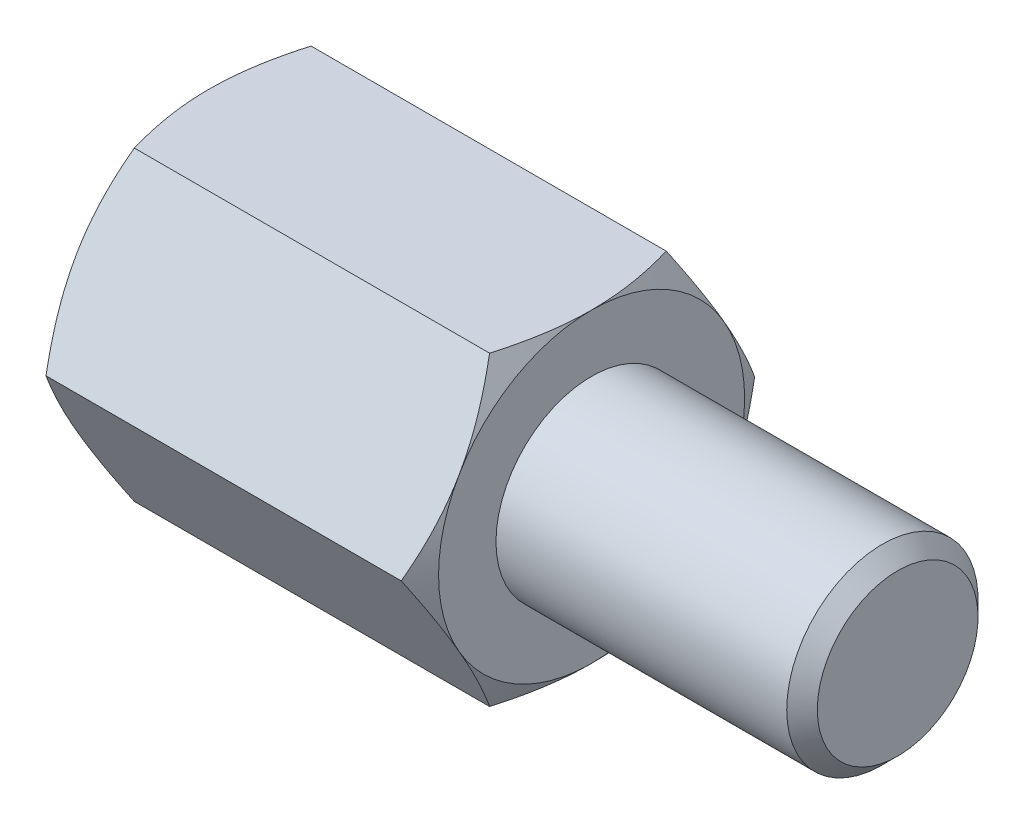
ISO-10303-21;
HEADER;
FILE_DESCRIPTION(('STEP AP214'),'2;1');
FILE_NAME('part.step','',(''),(''),'','','');
FILE_SCHEMA(('AUTOMOTIVE_DESIGN { 1 0 10303 214 1 1 1 1 }'));
ENDSEC;
DATA;
#1=APPLICATION_CONTEXT('core data for automotive mechanical design processes');
#2=APPLICATION_PROTOCOL_DEFINITION('international standard','automotive_design',2000,#1);
#3=PRODUCT_CONTEXT('',#1,'mechanical');
#4=PRODUCT('Part','Part','',(#3));
#5=PRODUCT_RELATED_PRODUCT_CATEGORY('part','',(#4));
#6=PRODUCT_DEFINITION_FORMATION('','',#4);
#7=PRODUCT_DEFINITION_CONTEXT('part definition',#1,'design');
#8=PRODUCT_DEFINITION('design','',#6,#7);
#9=PRODUCT_DEFINITION_SHAPE('','',#8);
#10=(LENGTH_UNIT() NAMED_UNIT(*) SI_UNIT(.MILLI.,.METRE.));
#11=(NAMED_UNIT(*) PLANE_ANGLE_UNIT() SI_UNIT($,.RADIAN.));
#12=(NAMED_UNIT(*) SI_UNIT($,.STERADIAN.) SOLID_ANGLE_UNIT());
#13=UNCERTAINTY_MEASURE_WITH_UNIT(LENGTH_MEASURE(1.E-05),#10,'distance_accuracy_value','');
#14=(GEOMETRIC_REPRESENTATION_CONTEXT(3) GLOBAL_UNCERTAINTY_ASSIGNED_CONTEXT((#13)) GLOBAL_UNIT_ASSIGNED_CONTEXT((#10,
#11,#12)) REPRESENTATION_CONTEXT('',''));
#15=CARTESIAN_POINT('',(0.,0.,0.));
#16=DIRECTION('',(0.,0.,1.));
#17=DIRECTION('',(1.,0.,0.));
#18=AXIS2_PLACEMENT_3D('',#15,#16,#17);
#19=CARTESIAN_POINT('',(5.,4.,-2.3094010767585));
#20=DIRECTION('',(1.,0.,0.));
#21=DIRECTION('',(0.,0.,-1.));
#22=AXIS2_PLACEMENT_3D('',#19,#20,#21);
#23=PLANE('',#22);
#24=CARTESIAN_POINT('',(5.,0.,0.));
#25=DIRECTION('',(1.,0.,0.));
#26=DIRECTION('',(0.,0.,-1.));
#27=AXIS2_PLACEMENT_3D('',#24,#25,#26);
#28=CIRCLE('',#27,4.);
#29=CARTESIAN_POINT('',(5.,-2.,-3.46410161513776));
#30=VERTEX_POINT('',#29);
#31=CARTESIAN_POINT('',(5.,2.,-3.46410161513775));
#32=VERTEX_POINT('',#31);
#33=EDGE_CURVE('E288',#30,#32,#28,.T.);
#34=ORIENTED_EDGE('',*,*,#33,.T.);
#35=CARTESIAN_POINT('',(5.,4.,0.));
#36=VERTEX_POINT('',#35);
#37=EDGE_CURVE('E53',#32,#36,#28,.T.);
#38=ORIENTED_EDGE('',*,*,#37,.T.);
#39=CARTESIAN_POINT('',(5.,2.,3.46410161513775));
#40=VERTEX_POINT('',#39);
#41=EDGE_CURVE('E297',#36,#40,#28,.T.);
#42=ORIENTED_EDGE('',*,*,#41,.T.);
#43=CARTESIAN_POINT('',(5.,-2.,3.46410161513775));
#44=VERTEX_POINT('',#43);
#45=EDGE_CURVE('E301',#40,#44,#28,.T.);
#46=ORIENTED_EDGE('',*,*,#45,.T.);
#47=CARTESIAN_POINT('',(5.,0.,0.));
#48=DIRECTION('',(-1.,0.,0.));
#49=DIRECTION('',(0.,-1.,0.));
#50=AXIS2_PLACEMENT_3D('',#47,#48,#49);
#51=CIRCLE('',#50,4.);
#52=CARTESIAN_POINT('',(5.,-4.,0.));
#53=VERTEX_POINT('',#52);
#54=EDGE_CURVE('E193',#53,#44,#51,.T.);
#55=ORIENTED_EDGE('',*,*,#54,.F.);
#56=EDGE_CURVE('E61',#53,#30,#28,.T.);
#57=ORIENTED_EDGE('',*,*,#56,.T.);
#58=EDGE_LOOP('',(#34,#38,#42,#46,#55,#57));
#59=FACE_BOUND('',#58,.T.);
#60=CARTESIAN_POINT('',(5.,0.,0.));
#61=DIRECTION('',(1.,0.,0.));
#62=DIRECTION('',(0.,0.,-1.));
#63=AXIS2_PLACEMENT_3D('',#60,#61,#62);
#64=CIRCLE('',#63,2.5);
#65=CARTESIAN_POINT('',(5.,0.,-2.5));
#66=VERTEX_POINT('',#65);
#67=EDGE_CURVE('E311',#66,#66,#64,.T.);
#68=ORIENTED_EDGE('',*,*,#67,.F.);
#69=EDGE_LOOP('',(#68));
#70=FACE_BOUND('',#69,.T.);
#71=ADVANCED_FACE('F37',(#59,#70),#23,.T.);
#72=CARTESIAN_POINT('',(5.,0.,-4.61880215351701));
#73=DIRECTION('',(0.,-0.5,0.866025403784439));
#74=DIRECTION('',(0.,-0.866025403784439,-0.5));
#75=AXIS2_PLACEMENT_3D('',#72,#73,#74);
#76=PLANE('',#75);
#77=CARTESIAN_POINT('',(4.64266774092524,-0.000200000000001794,-4.61891762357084));
#78=CARTESIAN_POINT('',(4.70128212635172,0.175579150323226,-4.5174314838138));
#79=CARTESIAN_POINT('',(4.75458967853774,0.352875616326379,-4.41506932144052));
#80=CARTESIAN_POINT('',(4.8476383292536,0.710538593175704,-4.2085725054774));
#81=CARTESIAN_POINT('',(4.8873465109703,0.890911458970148,-4.10443418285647));
#82=CARTESIAN_POINT('',(4.94915778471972,1.24942181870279,-3.89744813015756));
#83=CARTESIAN_POINT('',(4.97167226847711,1.42750415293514,-3.79463224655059));
#84=CARTESIAN_POINT('',(4.99854937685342,1.78450671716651,-3.58851671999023));
#85=CARTESIAN_POINT('',(5.00293425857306,1.9634256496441,-3.48521782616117));
#86=CARTESIAN_POINT('',(4.99380992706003,2.29774284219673,-3.29219970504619));
#87=CARTESIAN_POINT('',(4.98254104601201,2.45319115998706,-3.20245157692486));
#88=CARTESIAN_POINT('',(4.94682600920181,2.76307505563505,-3.02354002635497));
#89=CARTESIAN_POINT('',(4.92236765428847,2.91750956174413,-2.93437722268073));
#90=CARTESIAN_POINT('',(4.86122393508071,3.22803232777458,-2.75509682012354));
#91=CARTESIAN_POINT('',(4.82427939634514,3.3840812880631,-2.6650019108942));
#92=CARTESIAN_POINT('',(4.74042992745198,3.69385183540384,-2.486155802));
#93=CARTESIAN_POINT('',(4.69354469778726,3.84757739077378,-2.39740231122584));
#94=CARTESIAN_POINT('',(4.64266774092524,4.0002,-2.30928560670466));
#95=B_SPLINE_CURVE_WITH_KNOTS('',3,(#77,#78,#79,#80,#81,#82,#83,#84,#85,#86,#87,#88,#89,#90,#91,
#92,#93,#94),.UNSPECIFIED.,.F.,.F.,(4,2,2,2,2,2,2,2,4),(0.,0.634047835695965,1.26961969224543,
1.88946157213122,2.50854226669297,3.04757825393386,3.58711366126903,4.13861653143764,
4.68903648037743),.UNSPECIFIED.);
#96=CARTESIAN_POINT('',(4.64273441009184,0.,-4.61880215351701));
#97=VERTEX_POINT('',#96);
#98=EDGE_CURVE('E343',#97,#32,#95,.T.);
#99=ORIENTED_EDGE('',*,*,#98,.F.);
#100=DIRECTION('',(-1.,0.,0.));
#101=VECTOR('',#100,1.);
#102=CARTESIAN_POINT('',(5.,0.,-4.61880215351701));
#103=LINE('',#102,#101);
#104=CARTESIAN_POINT('',(-4.64273441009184,0.,-4.61880215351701));
#105=VERTEX_POINT('',#104);
#106=EDGE_CURVE('E264',#97,#105,#103,.T.);
#107=ORIENTED_EDGE('',*,*,#106,.T.);
#108=CARTESIAN_POINT('',(-4.64266774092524,4.0002,-2.30928560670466));
#109=CARTESIAN_POINT('',(-4.70128212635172,3.82442084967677,-2.4107717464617));
#110=CARTESIAN_POINT('',(-4.75458967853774,3.64712438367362,-2.51313390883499));
#111=CARTESIAN_POINT('',(-4.8476383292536,3.28946140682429,-2.71963072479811));
#112=CARTESIAN_POINT('',(-4.8873465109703,3.10908854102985,-2.82376904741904));
#113=CARTESIAN_POINT('',(-4.94915778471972,2.75057818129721,-3.03075510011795));
#114=CARTESIAN_POINT('',(-4.97167226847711,2.57249584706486,-3.13357098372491));
#115=CARTESIAN_POINT('',(-4.99854937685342,2.21549328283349,-3.33968651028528));
#116=CARTESIAN_POINT('',(-5.00293425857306,2.0365743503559,-3.44298540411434));
#117=CARTESIAN_POINT('',(-4.99380992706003,1.70225715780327,-3.63600352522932));
#118=CARTESIAN_POINT('',(-4.98254104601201,1.54680884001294,-3.72575165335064));
#119=CARTESIAN_POINT('',(-4.94682600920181,1.23692494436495,-3.90466320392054));
#120=CARTESIAN_POINT('',(-4.92236765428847,1.08249043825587,-3.99382600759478));
#121=CARTESIAN_POINT('',(-4.86122393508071,0.771967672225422,-4.17310641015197));
#122=CARTESIAN_POINT('',(-4.82427939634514,0.615918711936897,-4.26320131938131));
#123=CARTESIAN_POINT('',(-4.74042992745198,0.30614816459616,-4.4420474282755));
#124=CARTESIAN_POINT('',(-4.69354469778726,0.152422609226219,-4.53080091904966));
#125=CARTESIAN_POINT('',(-4.64266774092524,-0.000200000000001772,-4.61891762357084));
#126=B_SPLINE_CURVE_WITH_KNOTS('',3,(#108,#109,#110,#111,#112,#113,#114,#115,#116,#117,#118,
#119,#120,#121,#122,#123,#124,#125),.UNSPECIFIED.,.F.,.F.,(4,2,2,2,2,2,2,2,4),(0.,
0.634047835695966,1.26961969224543,1.88946157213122,2.50854226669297,3.04757825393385,
3.58711366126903,4.13861653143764,4.68903648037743),.UNSPECIFIED.);
#127=CARTESIAN_POINT('',(-5.,2.,-3.46410161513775));
#128=VERTEX_POINT('',#127);
#129=EDGE_CURVE('E361',#128,#105,#126,.T.);
#130=ORIENTED_EDGE('',*,*,#129,.F.);
#131=CARTESIAN_POINT('',(-4.64273441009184,4.,-2.3094010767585));
#132=VERTEX_POINT('',#131);
#133=EDGE_CURVE('E365',#132,#128,#126,.T.);
#134=ORIENTED_EDGE('',*,*,#133,.F.);
#135=DIRECTION('',(-1.,0.,0.));
#136=VECTOR('',#135,1.);
#137=CARTESIAN_POINT('',(5.,4.,-2.3094010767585));
#138=LINE('',#137,#136);
#139=CARTESIAN_POINT('',(4.64273441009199,4.,-2.30940107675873));
#140=VERTEX_POINT('',#139);
#141=EDGE_CURVE('E279',#140,#132,#138,.T.);
#142=ORIENTED_EDGE('',*,*,#141,.F.);
#143=EDGE_CURVE('E229',#32,#140,#95,.T.);
#144=ORIENTED_EDGE('',*,*,#143,.F.);
#145=EDGE_LOOP('',(#99,#107,#130,#134,#142,#144));
#146=FACE_BOUND('',#145,.T.);
#147=ADVANCED_FACE('F148',(#146),#76,.F.);
#148=CARTESIAN_POINT('',(5.,4.,-2.3094010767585));
#149=DIRECTION('',(0.,-1.,0.));
#150=DIRECTION('',(0.,0.,-1.));
#151=AXIS2_PLACEMENT_3D('',#148,#149,#150);
#152=PLANE('',#151);
#153=CARTESIAN_POINT('',(3.00829070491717,4.,-6.28479524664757));
#154=CARTESIAN_POINT('',(3.09370060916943,4.,-6.10939349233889));
#155=CARTESIAN_POINT('',(3.17831482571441,4.,-5.93359774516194));
#156=CARTESIAN_POINT('',(3.34550596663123,4.,-5.58100905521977));
#157=CARTESIAN_POINT('',(3.42808258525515,4.,-5.40421596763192));
#158=CARTESIAN_POINT('',(3.59115082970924,4.,-5.04855089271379));
#159=CARTESIAN_POINT('',(3.67162934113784,4.,-4.86967287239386));
#160=CARTESIAN_POINT('',(3.82940015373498,4.,-4.51052237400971));
#161=CARTESIAN_POINT('',(3.90669260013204,4.,-4.33024995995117));
#162=CARTESIAN_POINT('',(4.05980205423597,4.,-3.96189114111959));
#163=CARTESIAN_POINT('',(4.135480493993,4.,-3.77374683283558));
#164=CARTESIAN_POINT('',(4.28130452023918,4.,-3.39528725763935));
#165=CARTESIAN_POINT('',(4.35144949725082,4.,-3.2049717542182));
#166=CARTESIAN_POINT('',(4.4844245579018,4.,-2.82219775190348));
#167=CARTESIAN_POINT('',(4.5472687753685,4.,-2.62974421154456));
#168=CARTESIAN_POINT('',(4.66367969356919,4.,-2.24207725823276));
#169=CARTESIAN_POINT('',(4.71724923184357,4.,-2.04686470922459));
#170=CARTESIAN_POINT('',(4.81230316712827,4.,-1.65467425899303));
#171=CARTESIAN_POINT('',(4.85385633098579,4.,-1.45771333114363));
#172=CARTESIAN_POINT('',(4.92259036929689,4.,-1.06125849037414));
#173=CARTESIAN_POINT('',(4.94977273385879,4.,-0.861764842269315));
#174=CARTESIAN_POINT('',(4.98724473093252,4.,-0.463879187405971));
#175=CARTESIAN_POINT('',(4.99775780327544,4.,-0.265508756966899));
#176=CARTESIAN_POINT('',(5.00159342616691,4.,0.131417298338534));
#177=CARTESIAN_POINT('',(4.99491584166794,4.,0.329972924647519));
#178=CARTESIAN_POINT('',(4.96964892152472,4.,0.664692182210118));
#179=CARTESIAN_POINT('',(4.95537089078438,4.,0.801202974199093));
#180=CARTESIAN_POINT('',(4.9195349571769,4.,1.07327201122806));
#181=CARTESIAN_POINT('',(4.89797613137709,4.,1.20883013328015));
#182=CARTESIAN_POINT('',(4.82350663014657,4.,1.61386939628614));
#183=CARTESIAN_POINT('',(4.76081499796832,4.,1.8815748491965));
#184=CARTESIAN_POINT('',(4.65151174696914,4.,2.28197262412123));
#185=CARTESIAN_POINT('',(4.61200931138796,4.,2.41672443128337));
#186=CARTESIAN_POINT('',(4.52875235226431,4.,2.6849206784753));
#187=CARTESIAN_POINT('',(4.4849977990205,4.,2.81836510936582));
#188=CARTESIAN_POINT('',(4.3939510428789,4.,3.08398596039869));
#189=CARTESIAN_POINT('',(4.34665989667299,4.,3.21616274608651));
#190=CARTESIAN_POINT('',(4.24911111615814,4.,3.47941134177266));
#191=CARTESIAN_POINT('',(4.1988535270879,4.,3.61048316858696));
#192=CARTESIAN_POINT('',(4.07132952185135,4.,3.93385125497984));
#193=CARTESIAN_POINT('',(3.9926014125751,4.,4.1255702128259));
#194=CARTESIAN_POINT('',(3.83096938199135,4.,4.5072455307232));
#195=CARTESIAN_POINT('',(3.74806513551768,4.,4.69720175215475));
#196=CARTESIAN_POINT('',(3.5789699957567,4.,5.0756995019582));
#197=CARTESIAN_POINT('',(3.49277827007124,4.,5.264240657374));
#198=CARTESIAN_POINT('',(3.3178011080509,4.,5.64011758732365));
#199=CARTESIAN_POINT('',(3.22901560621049,4.,5.82745333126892));
#200=CARTESIAN_POINT('',(2.95934323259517,4.,6.3884442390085));
#201=CARTESIAN_POINT('',(2.77535618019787,4.,6.76060781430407));
#202=CARTESIAN_POINT('',(2.4019562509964,4.,7.50211228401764));
#203=CARTESIAN_POINT('',(2.21254420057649,4.,7.87145359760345));
#204=CARTESIAN_POINT('',(1.84738774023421,4.,8.57450173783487));
#205=CARTESIAN_POINT('',(1.67197556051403,4.,8.90838144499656));
#206=CARTESIAN_POINT('',(1.31880976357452,4.,9.57491712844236));
#207=CARTESIAN_POINT('',(1.14105604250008,4.,9.9075730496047));
#208=CARTESIAN_POINT('',(0.784293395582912,4.,10.5709822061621));
#209=CARTESIAN_POINT('',(0.605289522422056,3.99999999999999,10.9017381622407));
#210=CARTESIAN_POINT('',(0.245907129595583,3.99999999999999,11.5624752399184));
#211=CARTESIAN_POINT('',(0.0655286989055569,3.99999999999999,11.8924564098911));
#212=CARTESIAN_POINT('',(-0.115357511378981,3.99999999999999,12.2221569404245));
#213=B_SPLINE_CURVE_WITH_KNOTS('',3,(#153,#154,#155,#156,#157,#158,#159,#160,#161,#162,#163,
#164,#165,#166,#167,#168,#169,#170,#171,#172,#173,#174,#175,#176,#177,#178,#179,#180,#181,#182,
#183,#184,#185,#186,#187,#188,#189,#190,#191,#192,#193,#194,#195,#196,#197,#198,#199,#200,#201,
#202,#203,#204,#205,#206,#207,#208,#209,#210,#211,#212),.UNSPECIFIED.,.F.,.F.,(4,2,2,2,2,2,2,2,
2,2,2,2,2,2,2,2,2,2,2,2,2,2,2,2,2,2,2,2,2,4),(0.,0.585280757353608,1.17064881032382,
1.75906864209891,2.34746162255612,2.95577704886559,3.56415938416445,4.17134357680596,
4.7783416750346,5.38179402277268,5.98518378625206,6.58041501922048,7.17565092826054,
7.58721910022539,7.99883946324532,8.82250155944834,9.24373134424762,9.66496407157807,
10.086071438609,10.5071723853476,11.1288656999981,11.7506074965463,12.3725077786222,
12.9944237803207,14.2398211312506,15.4850297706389,16.6164791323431,17.7479788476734,
18.8762380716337,20.0044248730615),.UNSPECIFIED.);
#214=EDGE_CURVE('E227',#140,#36,#213,.T.);
#215=ORIENTED_EDGE('',*,*,#214,.F.);
#216=ORIENTED_EDGE('',*,*,#141,.T.);
#217=CARTESIAN_POINT('',(-3.00829070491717,4.,-6.28479524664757));
#218=CARTESIAN_POINT('',(-3.09370060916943,4.,-6.10939349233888));
#219=CARTESIAN_POINT('',(-3.17831482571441,4.,-5.93359774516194));
#220=CARTESIAN_POINT('',(-3.34550596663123,4.,-5.58100905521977));
#221=CARTESIAN_POINT('',(-3.42808258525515,4.,-5.40421596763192));
#222=CARTESIAN_POINT('',(-3.59115082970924,4.,-5.04855089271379));
#223=CARTESIAN_POINT('',(-3.67162934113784,4.,-4.86967287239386));
#224=CARTESIAN_POINT('',(-3.82940015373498,4.,-4.51052237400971));
#225=CARTESIAN_POINT('',(-3.90669260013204,4.,-4.33024995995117));
#226=CARTESIAN_POINT('',(-4.05980205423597,4.,-3.96189114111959));
#227=CARTESIAN_POINT('',(-4.135480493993,4.,-3.77374683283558));
#228=CARTESIAN_POINT('',(-4.28130452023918,4.,-3.39528725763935));
#229=CARTESIAN_POINT('',(-4.35144949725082,4.,-3.2049717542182));
#230=CARTESIAN_POINT('',(-4.4844245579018,4.,-2.82219775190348));
#231=CARTESIAN_POINT('',(-4.5472687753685,4.,-2.62974421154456));
#232=CARTESIAN_POINT('',(-4.66367969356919,4.,-2.24207725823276));
#233=CARTESIAN_POINT('',(-4.71724923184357,4.,-2.04686470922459));
#234=CARTESIAN_POINT('',(-4.81230316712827,4.,-1.65467425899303));
#235=CARTESIAN_POINT('',(-4.85385633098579,4.,-1.45771333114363));
#236=CARTESIAN_POINT('',(-4.92259036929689,4.,-1.06125849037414));
#237=CARTESIAN_POINT('',(-4.94977273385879,4.,-0.861764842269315));
#238=CARTESIAN_POINT('',(-4.98724473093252,4.,-0.463879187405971));
#239=CARTESIAN_POINT('',(-4.99775780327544,4.,-0.265508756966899));
#240=CARTESIAN_POINT('',(-5.00159342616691,4.,0.131417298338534));
#241=CARTESIAN_POINT('',(-4.99491584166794,4.,0.329972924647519));
#242=CARTESIAN_POINT('',(-4.96964892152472,4.,0.664692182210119));
#243=CARTESIAN_POINT('',(-4.95537089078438,4.,0.801202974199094));
#244=CARTESIAN_POINT('',(-4.9195349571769,4.,1.07327201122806));
#245=CARTESIAN_POINT('',(-4.89797613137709,4.,1.20883013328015));
#246=CARTESIAN_POINT('',(-4.82350663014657,4.,1.61386939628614));
#247=CARTESIAN_POINT('',(-4.76081499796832,4.,1.8815748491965));
#248=CARTESIAN_POINT('',(-4.65151174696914,4.,2.28197262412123));
#249=CARTESIAN_POINT('',(-4.61200931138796,4.,2.41672443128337));
#250=CARTESIAN_POINT('',(-4.52875235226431,4.,2.68492067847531));
#251=CARTESIAN_POINT('',(-4.48499779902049,4.,2.81836510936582));
#252=CARTESIAN_POINT('',(-4.39395104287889,4.,3.0839859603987));
#253=CARTESIAN_POINT('',(-4.34665989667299,4.,3.21616274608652));
#254=CARTESIAN_POINT('',(-4.24911111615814,4.,3.47941134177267));
#255=CARTESIAN_POINT('',(-4.1988535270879,4.,3.61048316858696));
#256=CARTESIAN_POINT('',(-4.07132952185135,4.,3.93385125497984));
#257=CARTESIAN_POINT('',(-3.9926014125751,4.,4.1255702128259));
#258=CARTESIAN_POINT('',(-3.83096938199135,4.,4.5072455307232));
#259=CARTESIAN_POINT('',(-3.74806513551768,4.,4.69720175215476));
#260=CARTESIAN_POINT('',(-3.5789699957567,4.,5.0756995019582));
#261=CARTESIAN_POINT('',(-3.49277827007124,4.,5.264240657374));
#262=CARTESIAN_POINT('',(-3.3178011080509,4.,5.64011758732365));
#263=CARTESIAN_POINT('',(-3.22901560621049,4.,5.82745333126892));
#264=CARTESIAN_POINT('',(-2.95934323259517,4.,6.3884442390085));
#265=CARTESIAN_POINT('',(-2.77535618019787,4.,6.76060781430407));
#266=CARTESIAN_POINT('',(-2.4019562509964,4.,7.50211228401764));
#267=CARTESIAN_POINT('',(-2.21254420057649,4.,7.87145359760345));
#268=CARTESIAN_POINT('',(-1.84738774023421,4.,8.57450173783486));
#269=CARTESIAN_POINT('',(-1.67197556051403,4.,8.90838144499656));
#270=CARTESIAN_POINT('',(-1.31880976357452,4.,9.57491712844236));
#271=CARTESIAN_POINT('',(-1.14105604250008,4.,9.9075730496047));
#272=CARTESIAN_POINT('',(-0.784293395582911,4.,10.5709822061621));
#273=CARTESIAN_POINT('',(-0.605289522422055,3.99999999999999,10.9017381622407));
#274=CARTESIAN_POINT('',(-0.245907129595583,3.99999999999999,11.5624752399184));
#275=CARTESIAN_POINT('',(-0.0655286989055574,3.99999999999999,11.8924564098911));
#276=CARTESIAN_POINT('',(0.115357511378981,3.99999999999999,12.2221569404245));
#277=B_SPLINE_CURVE_WITH_KNOTS('',3,(#217,#218,#219,#220,#221,#222,#223,#224,#225,#226,#227,
#228,#229,#230,#231,#232,#233,#234,#235,#236,#237,#238,#239,#240,#241,#242,#243,#244,#245,#246,
#247,#248,#249,#250,#251,#252,#253,#254,#255,#256,#257,#258,#259,#260,#261,#262,#263,#264,#265,
#266,#267,#268,#269,#270,#271,#272,#273,#274,#275,#276),.UNSPECIFIED.,.F.,.F.,(4,2,2,2,2,2,2,2,
2,2,2,2,2,2,2,2,2,2,2,2,2,2,2,2,2,2,2,2,2,4),(0.,0.585280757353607,1.17064881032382,
1.75906864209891,2.34746162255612,2.95577704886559,3.56415938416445,4.17134357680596,
4.7783416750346,5.38179402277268,5.98518378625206,6.58041501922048,7.17565092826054,
7.58721910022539,7.99883946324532,8.82250155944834,9.24373134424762,9.66496407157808,
10.086071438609,10.5071723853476,11.1288656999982,11.7506074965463,12.3725077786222,
12.9944237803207,14.2398211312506,15.4850297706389,16.6164791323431,17.7479788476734,
18.8762380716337,20.0044248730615),.UNSPECIFIED.);
#278=CARTESIAN_POINT('',(-5.,4.,0.));
#279=VERTEX_POINT('',#278);
#280=EDGE_CURVE('E241',#279,#132,#277,.F.);
#281=ORIENTED_EDGE('',*,*,#280,.F.);
#282=CARTESIAN_POINT('',(-4.64273441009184,4.,2.3094010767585));
#283=VERTEX_POINT('',#282);
#284=EDGE_CURVE('E249',#283,#279,#277,.F.);
#285=ORIENTED_EDGE('',*,*,#284,.F.);
#286=DIRECTION('',(-1.,0.,0.));
#287=VECTOR('',#286,1.);
#288=CARTESIAN_POINT('',(5.,4.,2.3094010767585));
#289=LINE('',#288,#287);
#290=CARTESIAN_POINT('',(4.64273441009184,4.,2.3094010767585));
#291=VERTEX_POINT('',#290);
#292=EDGE_CURVE('E276',#291,#283,#289,.T.);
#293=ORIENTED_EDGE('',*,*,#292,.F.);
#294=EDGE_CURVE('E221',#36,#291,#213,.T.);
#295=ORIENTED_EDGE('',*,*,#294,.F.);
#296=EDGE_LOOP('',(#215,#216,#281,#285,#293,#295));
#297=FACE_BOUND('',#296,.T.);
#298=ADVANCED_FACE('F153',(#297),#152,.F.);
#299=CARTESIAN_POINT('',(5.,4.,2.3094010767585));
#300=DIRECTION('',(0.,-0.5,-0.866025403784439));
#301=DIRECTION('',(0.,0.866025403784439,-0.5));
#302=AXIS2_PLACEMENT_3D('',#299,#300,#301);
#303=PLANE('',#302);
#304=CARTESIAN_POINT('',(4.64266774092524,4.0002,2.30928560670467));
#305=CARTESIAN_POINT('',(4.70128212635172,3.82442084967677,2.4107717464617));
#306=CARTESIAN_POINT('',(4.75458967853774,3.64712438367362,2.51313390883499));
#307=CARTESIAN_POINT('',(4.8476383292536,3.28946140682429,2.71963072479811));
#308=CARTESIAN_POINT('',(4.8873465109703,3.10908854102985,2.82376904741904));
#309=CARTESIAN_POINT('',(4.94915778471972,2.75057818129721,3.03075510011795));
#310=CARTESIAN_POINT('',(4.97167226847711,2.57249584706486,3.13357098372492));
#311=CARTESIAN_POINT('',(4.99854937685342,2.21549328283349,3.33968651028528));
#312=CARTESIAN_POINT('',(5.00293425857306,2.0365743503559,3.44298540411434));
#313=CARTESIAN_POINT('',(4.99380992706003,1.70225715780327,3.63600352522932));
#314=CARTESIAN_POINT('',(4.98254104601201,1.54680884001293,3.72575165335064));
#315=CARTESIAN_POINT('',(4.94682600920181,1.23692494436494,3.90466320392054));
#316=CARTESIAN_POINT('',(4.92236765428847,1.08249043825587,3.99382600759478));
#317=CARTESIAN_POINT('',(4.86122393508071,0.771967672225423,4.17310641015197));
#318=CARTESIAN_POINT('',(4.82427939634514,0.615918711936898,4.26320131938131));
#319=CARTESIAN_POINT('',(4.74042992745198,0.306148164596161,4.4420474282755));
#320=CARTESIAN_POINT('',(4.69354469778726,0.152422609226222,4.53080091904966));
#321=CARTESIAN_POINT('',(4.64266774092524,-0.00019999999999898,4.61891762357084));
#322=B_SPLINE_CURVE_WITH_KNOTS('',3,(#304,#305,#306,#307,#308,#309,#310,#311,#312,#313,#314,
#315,#316,#317,#318,#319,#320,#321),.UNSPECIFIED.,.F.,.F.,(4,2,2,2,2,2,2,2,4),(0.,
0.634047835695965,1.26961969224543,1.88946157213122,2.50854226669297,3.04757825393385,
3.58711366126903,4.13861653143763,4.68903648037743),.UNSPECIFIED.);
#323=EDGE_CURVE('E228',#291,#40,#322,.T.);
#324=ORIENTED_EDGE('',*,*,#323,.F.);
#325=ORIENTED_EDGE('',*,*,#292,.T.);
#326=CARTESIAN_POINT('',(-4.64266774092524,-0.000199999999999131,4.61891762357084));
#327=CARTESIAN_POINT('',(-4.70128212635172,0.175579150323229,4.5174314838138));
#328=CARTESIAN_POINT('',(-4.75458967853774,0.352875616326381,4.41506932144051));
#329=CARTESIAN_POINT('',(-4.8476383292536,0.710538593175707,4.20857250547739));
#330=CARTESIAN_POINT('',(-4.8873465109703,0.890911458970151,4.10443418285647));
#331=CARTESIAN_POINT('',(-4.94915778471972,1.24942181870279,3.89744813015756));
#332=CARTESIAN_POINT('',(-4.97167226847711,1.42750415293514,3.79463224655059));
#333=CARTESIAN_POINT('',(-4.99854937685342,1.78450671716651,3.58851671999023));
#334=CARTESIAN_POINT('',(-5.00293425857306,1.9634256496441,3.48521782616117));
#335=CARTESIAN_POINT('',(-4.99380992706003,2.29774284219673,3.29219970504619));
#336=CARTESIAN_POINT('',(-4.98254104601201,2.45319115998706,3.20245157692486));
#337=CARTESIAN_POINT('',(-4.94682600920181,2.76307505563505,3.02354002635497));
#338=CARTESIAN_POINT('',(-4.92236765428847,2.91750956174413,2.93437722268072));
#339=CARTESIAN_POINT('',(-4.86122393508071,3.22803232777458,2.75509682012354));
#340=CARTESIAN_POINT('',(-4.82427939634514,3.3840812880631,2.6650019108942));
#341=CARTESIAN_POINT('',(-4.74042992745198,3.69385183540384,2.48615580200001));
#342=CARTESIAN_POINT('',(-4.69354469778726,3.84757739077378,2.39740231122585));
#343=CARTESIAN_POINT('',(-4.64266774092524,4.0002,2.30928560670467));
#344=B_SPLINE_CURVE_WITH_KNOTS('',3,(#326,#327,#328,#329,#330,#331,#332,#333,#334,#335,#336,
#337,#338,#339,#340,#341,#342,#343),.UNSPECIFIED.,.F.,.F.,(4,2,2,2,2,2,2,2,4),(0.,
0.634047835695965,1.26961969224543,1.88946157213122,2.50854226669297,3.04757825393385,
3.58711366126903,4.13861653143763,4.68903648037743),.UNSPECIFIED.);
#345=CARTESIAN_POINT('',(-5.,2.,3.46410161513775));
#346=VERTEX_POINT('',#345);
#347=EDGE_CURVE('E255',#346,#283,#344,.T.);
#348=ORIENTED_EDGE('',*,*,#347,.F.);
#349=CARTESIAN_POINT('',(-4.64273441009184,0.,4.618802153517));
#350=VERTEX_POINT('',#349);
#351=EDGE_CURVE('E262',#350,#346,#344,.T.);
#352=ORIENTED_EDGE('',*,*,#351,.F.);
#353=DIRECTION('',(-1.,0.,0.));
#354=VECTOR('',#353,1.);
#355=CARTESIAN_POINT('',(5.,0.,4.618802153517));
#356=LINE('',#355,#354);
#357=CARTESIAN_POINT('',(4.64273441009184,0.,4.618802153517));
#358=VERTEX_POINT('',#357);
#359=EDGE_CURVE('E273',#358,#350,#356,.T.);
#360=ORIENTED_EDGE('',*,*,#359,.F.);
#361=EDGE_CURVE('E215',#40,#358,#322,.T.);
#362=ORIENTED_EDGE('',*,*,#361,.F.);
#363=EDGE_LOOP('',(#324,#325,#348,#352,#360,#362));
#364=FACE_BOUND('',#363,.T.);
#365=ADVANCED_FACE('F235',(#364),#303,.F.);
#366=CARTESIAN_POINT('',(5.,0.,4.618802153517));
#367=DIRECTION('',(0.,0.5,-0.866025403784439));
#368=DIRECTION('',(0.,0.866025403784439,0.5));
#369=AXIS2_PLACEMENT_3D('',#366,#367,#368);
#370=PLANE('',#369);
#371=CARTESIAN_POINT('',(4.64266774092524,0.000200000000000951,4.61891762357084));
#372=CARTESIAN_POINT('',(4.70128212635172,-0.175579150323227,4.5174314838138));
#373=CARTESIAN_POINT('',(4.75458967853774,-0.352875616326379,4.41506932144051));
#374=CARTESIAN_POINT('',(4.8476383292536,-0.710538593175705,4.20857250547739));
#375=CARTESIAN_POINT('',(4.8873465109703,-0.890911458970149,4.10443418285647));
#376=CARTESIAN_POINT('',(4.94915778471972,-1.24942181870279,3.89744813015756));
#377=CARTESIAN_POINT('',(4.97167226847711,-1.42750415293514,3.79463224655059));
#378=CARTESIAN_POINT('',(4.99854937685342,-1.78450671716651,3.58851671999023));
#379=CARTESIAN_POINT('',(5.00293425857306,-1.9634256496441,3.48521782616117));
#380=CARTESIAN_POINT('',(4.99380992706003,-2.29774284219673,3.29219970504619));
#381=CARTESIAN_POINT('',(4.98254104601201,-2.45319115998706,3.20245157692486));
#382=CARTESIAN_POINT('',(4.94682600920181,-2.76307505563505,3.02354002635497));
#383=CARTESIAN_POINT('',(4.92236765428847,-2.91750956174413,2.93437722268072));
#384=CARTESIAN_POINT('',(4.86122393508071,-3.22803232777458,2.75509682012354));
#385=CARTESIAN_POINT('',(4.82427939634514,-3.3840812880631,2.6650019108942));
#386=CARTESIAN_POINT('',(4.74042992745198,-3.69385183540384,2.48615580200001));
#387=CARTESIAN_POINT('',(4.69354469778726,-3.84757739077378,2.39740231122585));
#388=CARTESIAN_POINT('',(4.64266774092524,-4.0002,2.30928560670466));
#389=B_SPLINE_CURVE_WITH_KNOTS('',3,(#371,#372,#373,#374,#375,#376,#377,#378,#379,#380,#381,
#382,#383,#384,#385,#386,#387,#388),.UNSPECIFIED.,.F.,.F.,(4,2,2,2,2,2,2,2,4),(0.,
0.634047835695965,1.26961969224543,1.88946157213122,2.50854226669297,3.04757825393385,
3.58711366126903,4.13861653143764,4.68903648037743),.UNSPECIFIED.);
#390=EDGE_CURVE('E417',#358,#44,#389,.T.);
#391=ORIENTED_EDGE('',*,*,#390,.F.);
#392=ORIENTED_EDGE('',*,*,#359,.T.);
#393=CARTESIAN_POINT('',(-4.64266774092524,-4.0002,2.30928560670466));
#394=CARTESIAN_POINT('',(-4.70128212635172,-3.82442084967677,2.4107717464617));
#395=CARTESIAN_POINT('',(-4.75458967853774,-3.64712438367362,2.51313390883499));
#396=CARTESIAN_POINT('',(-4.8476383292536,-3.28946140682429,2.71963072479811));
#397=CARTESIAN_POINT('',(-4.8873465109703,-3.10908854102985,2.82376904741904));
#398=CARTESIAN_POINT('',(-4.94915778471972,-2.75057818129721,3.03075510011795));
#399=CARTESIAN_POINT('',(-4.97167226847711,-2.57249584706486,3.13357098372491));
#400=CARTESIAN_POINT('',(-4.99854937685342,-2.21549328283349,3.33968651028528));
#401=CARTESIAN_POINT('',(-5.00293425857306,-2.0365743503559,3.44298540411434));
#402=CARTESIAN_POINT('',(-4.99380992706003,-1.70225715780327,3.63600352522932));
#403=CARTESIAN_POINT('',(-4.98254104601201,-1.54680884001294,3.72575165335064));
#404=CARTESIAN_POINT('',(-4.94682600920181,-1.23692494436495,3.90466320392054));
#405=CARTESIAN_POINT('',(-4.92236765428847,-1.08249043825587,3.99382600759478));
#406=CARTESIAN_POINT('',(-4.86122393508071,-0.771967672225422,4.17310641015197));
#407=CARTESIAN_POINT('',(-4.82427939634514,-0.615918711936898,4.26320131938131));
#408=CARTESIAN_POINT('',(-4.74042992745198,-0.30614816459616,4.4420474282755));
#409=CARTESIAN_POINT('',(-4.69354469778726,-0.15242260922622,4.53080091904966));
#410=CARTESIAN_POINT('',(-4.64266774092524,0.000200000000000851,4.61891762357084));
#411=B_SPLINE_CURVE_WITH_KNOTS('',3,(#393,#394,#395,#396,#397,#398,#399,#400,#401,#402,#403,
#404,#405,#406,#407,#408,#409,#410),.UNSPECIFIED.,.F.,.F.,(4,2,2,2,2,2,2,2,4),(0.,
0.634047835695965,1.26961969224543,1.88946157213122,2.50854226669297,3.04757825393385,
3.58711366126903,4.13861653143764,4.68903648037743),.UNSPECIFIED.);
#412=CARTESIAN_POINT('',(-5.,-2.,3.46410161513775));
#413=VERTEX_POINT('',#412);
#414=EDGE_CURVE('E263',#413,#350,#411,.T.);
#415=ORIENTED_EDGE('',*,*,#414,.F.);
#416=CARTESIAN_POINT('',(-4.64273441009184,-4.,2.3094010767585));
#417=VERTEX_POINT('',#416);
#418=EDGE_CURVE('E250',#417,#413,#411,.T.);
#419=ORIENTED_EDGE('',*,*,#418,.F.);
#420=DIRECTION('',(-1.,0.,0.));
#421=VECTOR('',#420,1.);
#422=CARTESIAN_POINT('',(5.,-4.,2.3094010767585));
#423=LINE('',#422,#421);
#424=CARTESIAN_POINT('',(4.64273441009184,-4.,2.3094010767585));
#425=VERTEX_POINT('',#424);
#426=EDGE_CURVE('E270',#425,#417,#423,.T.);
#427=ORIENTED_EDGE('',*,*,#426,.F.);
#428=EDGE_CURVE('E210',#44,#425,#389,.T.);
#429=ORIENTED_EDGE('',*,*,#428,.F.);
#430=EDGE_LOOP('',(#391,#392,#415,#419,#427,#429));
#431=FACE_BOUND('',#430,.T.);
#432=ADVANCED_FACE('F399',(#431),#370,.F.);
#433=CARTESIAN_POINT('',(5.,-4.,2.3094010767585));
#434=DIRECTION('',(0.,1.,0.));
#435=DIRECTION('',(0.,0.,1.));
#436=AXIS2_PLACEMENT_3D('',#433,#434,#435);
#437=PLANE('',#436);
#438=CARTESIAN_POINT('',(3.00829070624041,-4.,-6.28479524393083));
#439=CARTESIAN_POINT('',(3.09370061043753,-4.,-6.10939348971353));
#440=CARTESIAN_POINT('',(3.1783148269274,-4.,-5.93359774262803));
#441=CARTESIAN_POINT('',(3.34550596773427,-4.,-5.58100905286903));
#442=CARTESIAN_POINT('',(3.42808258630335,-4.,-5.40421596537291));
#443=CARTESIAN_POINT('',(3.59115083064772,-4.,-5.04855089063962));
#444=CARTESIAN_POINT('',(3.67162934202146,-4.,-4.86967287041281));
#445=CARTESIAN_POINT('',(3.82940015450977,-4.,-4.51052237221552));
#446=CARTESIAN_POINT('',(3.90669260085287,-4.,-4.33024995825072));
#447=CARTESIAN_POINT('',(4.05980205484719,-4.,-3.96189113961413));
#448=CARTESIAN_POINT('',(4.13548049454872,-4.,-3.77374683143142));
#449=CARTESIAN_POINT('',(4.28130452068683,-4.,-3.39528725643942));
#450=CARTESIAN_POINT('',(4.35144949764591,-4.,-3.20497175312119));
#451=CARTESIAN_POINT('',(4.48442455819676,-4.,-2.82219775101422));
#452=CARTESIAN_POINT('',(4.54726877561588,-4.,-2.62974421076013));
#453=CARTESIAN_POINT('',(4.66367969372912,-4.,-2.24207725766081));
#454=CARTESIAN_POINT('',(4.71724923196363,-4.,-2.04686470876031));
#455=CARTESIAN_POINT('',(4.81230316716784,-4.,-1.65467425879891));
#456=CARTESIAN_POINT('',(4.85385633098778,-4.,-1.45771333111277));
#457=CARTESIAN_POINT('',(4.9225903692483,-4.,-1.06125849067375));
#458=CARTESIAN_POINT('',(4.94977273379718,-4.,-0.861764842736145));
#459=CARTESIAN_POINT('',(4.9872447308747,-4.,-0.463879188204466));
#460=CARTESIAN_POINT('',(4.99775780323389,-4.,-0.265508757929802));
#461=CARTESIAN_POINT('',(5.00159342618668,-4.,0.131417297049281));
#462=CARTESIAN_POINT('',(4.99491584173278,-4.,0.329972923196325));
#463=CARTESIAN_POINT('',(4.96964892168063,-4.,0.664692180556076));
#464=CARTESIAN_POINT('',(4.95537089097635,-4.,0.80120297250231));
#465=CARTESIAN_POINT('',(4.9195349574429,-4.,1.07327200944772));
#466=CARTESIAN_POINT('',(4.89797613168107,-4.,1.208830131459));
#467=CARTESIAN_POINT('',(4.82350663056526,-4.,1.6138693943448));
#468=CARTESIAN_POINT('',(4.76081499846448,-4.,1.88157484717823));
#469=CARTESIAN_POINT('',(4.65151174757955,-4.,2.28197262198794));
#470=CARTESIAN_POINT('',(4.6120093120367,-4.,2.41672442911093));
#471=CARTESIAN_POINT('',(4.52875235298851,-4.,2.68492067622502));
#472=CARTESIAN_POINT('',(4.48499779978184,-4.,2.81836510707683));
#473=CARTESIAN_POINT('',(4.39395104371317,-4.,3.0839859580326));
#474=CARTESIAN_POINT('',(4.34665989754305,-4.,3.21616274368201));
#475=CARTESIAN_POINT('',(4.24911111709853,-4.,3.47941133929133));
#476=CARTESIAN_POINT('',(4.19885352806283,-4.,3.61048316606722));
#477=CARTESIAN_POINT('',(4.07132952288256,-4.,3.93385125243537));
#478=CARTESIAN_POINT('',(3.99260141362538,-4.,4.12557021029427));
#479=CARTESIAN_POINT('',(3.83096938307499,-4.,4.50724552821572));
#480=CARTESIAN_POINT('',(3.7480651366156,-4.,4.69720174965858));
#481=CARTESIAN_POINT('',(3.57896999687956,-4.,5.07569949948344));
#482=CARTESIAN_POINT('',(3.49277827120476,-4.,5.26424065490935));
#483=CARTESIAN_POINT('',(3.31780110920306,-4.,5.64011758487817));
#484=CARTESIAN_POINT('',(3.22901560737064,-4.,5.8274533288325));
#485=CARTESIAN_POINT('',(2.95934323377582,-4.,6.38844423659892));
#486=CARTESIAN_POINT('',(2.77535618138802,-4.,6.76060781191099));
#487=CARTESIAN_POINT('',(2.40195625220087,-4.,7.50211228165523));
#488=CARTESIAN_POINT('',(2.2125442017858,-4.,7.8714535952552));
#489=CARTESIAN_POINT('',(1.84738774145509,-4.,8.57450173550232));
#490=CARTESIAN_POINT('',(1.671975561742,-4.,8.90838144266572));
#491=CARTESIAN_POINT('',(1.3188097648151,-4.,9.57491712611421));
#492=CARTESIAN_POINT('',(1.1410560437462,-4.,9.90757304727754));
#493=CARTESIAN_POINT('',(0.78429339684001,-4.,10.5709822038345));
#494=CARTESIAN_POINT('',(0.605289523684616,-4.,10.9017381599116));
#495=CARTESIAN_POINT('',(0.245907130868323,-4.,11.562475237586));
#496=CARTESIAN_POINT('',(0.0655287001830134,-4.,11.8924564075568));
#497=CARTESIAN_POINT('',(-0.115357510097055,-4.,12.2221569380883));
#498=B_SPLINE_CURVE_WITH_KNOTS('',3,(#438,#439,#440,#441,#442,#443,#444,#445,#446,#447,#448,
#449,#450,#451,#452,#453,#454,#455,#456,#457,#458,#459,#460,#461,#462,#463,#464,#465,#466,#467,
#468,#469,#470,#471,#472,#473,#474,#475,#476,#477,#478,#479,#480,#481,#482,#483,#484,#485,#486,
#487,#488,#489,#490,#491,#492,#493,#494,#495,#496,#497),.UNSPECIFIED.,.F.,.F.,(4,2,2,2,2,2,2,2,
2,2,2,2,2,2,2,2,2,2,2,2,2,2,2,2,2,2,2,2,2,4),(0.,0.585280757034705,1.17064880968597,
1.75906864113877,2.34746162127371,2.95577704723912,3.56415938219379,4.17134357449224,
4.77834167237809,5.38179401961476,5.98518378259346,6.58041501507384,7.1756509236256,
7.5872190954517,7.99883945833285,8.82250155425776,9.24373133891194,9.66496406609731,
10.0860714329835,10.5071723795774,11.1288656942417,11.7506074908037,12.3725077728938,
12.9944237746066,14.2398211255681,15.4850297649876,16.6164791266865,17.7479788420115,
18.8762380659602,20.0044248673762),.UNSPECIFIED.);
#499=EDGE_CURVE('E330',#425,#53,#498,.F.);
#500=ORIENTED_EDGE('',*,*,#499,.F.);
#501=ORIENTED_EDGE('',*,*,#426,.T.);
#502=CARTESIAN_POINT('',(-3.00829070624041,-4.,-6.28479524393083));
#503=CARTESIAN_POINT('',(-3.09370061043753,-4.,-6.10939348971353));
#504=CARTESIAN_POINT('',(-3.1783148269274,-4.,-5.93359774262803));
#505=CARTESIAN_POINT('',(-3.34550596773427,-4.,-5.58100905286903));
#506=CARTESIAN_POINT('',(-3.42808258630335,-4.,-5.40421596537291));
#507=CARTESIAN_POINT('',(-3.59115083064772,-4.,-5.04855089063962));
#508=CARTESIAN_POINT('',(-3.67162934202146,-4.,-4.86967287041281));
#509=CARTESIAN_POINT('',(-3.82940015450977,-4.,-4.51052237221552));
#510=CARTESIAN_POINT('',(-3.90669260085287,-4.,-4.33024995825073));
#511=CARTESIAN_POINT('',(-4.05980205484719,-4.,-3.96189113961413));
#512=CARTESIAN_POINT('',(-4.13548049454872,-4.,-3.77374683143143));
#513=CARTESIAN_POINT('',(-4.28130452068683,-4.,-3.39528725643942));
#514=CARTESIAN_POINT('',(-4.35144949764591,-4.,-3.2049717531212));
#515=CARTESIAN_POINT('',(-4.48442455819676,-4.,-2.82219775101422));
#516=CARTESIAN_POINT('',(-4.54726877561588,-4.,-2.62974421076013));
#517=CARTESIAN_POINT('',(-4.66367969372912,-4.,-2.24207725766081));
#518=CARTESIAN_POINT('',(-4.71724923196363,-4.,-2.04686470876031));
#519=CARTESIAN_POINT('',(-4.81230316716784,-4.,-1.65467425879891));
#520=CARTESIAN_POINT('',(-4.85385633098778,-4.,-1.45771333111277));
#521=CARTESIAN_POINT('',(-4.9225903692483,-4.,-1.06125849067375));
#522=CARTESIAN_POINT('',(-4.94977273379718,-4.,-0.861764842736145));
#523=CARTESIAN_POINT('',(-4.9872447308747,-4.,-0.463879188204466));
#524=CARTESIAN_POINT('',(-4.99775780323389,-4.,-0.265508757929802));
#525=CARTESIAN_POINT('',(-5.00159342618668,-4.,0.131417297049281));
#526=CARTESIAN_POINT('',(-4.99491584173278,-4.,0.329972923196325));
#527=CARTESIAN_POINT('',(-4.96964892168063,-4.,0.664692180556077));
#528=CARTESIAN_POINT('',(-4.95537089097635,-4.,0.801202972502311));
#529=CARTESIAN_POINT('',(-4.9195349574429,-4.,1.07327200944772));
#530=CARTESIAN_POINT('',(-4.89797613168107,-4.,1.208830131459));
#531=CARTESIAN_POINT('',(-4.82350663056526,-4.,1.6138693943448));
#532=CARTESIAN_POINT('',(-4.76081499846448,-4.,1.88157484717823));
#533=CARTESIAN_POINT('',(-4.65151174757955,-4.,2.28197262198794));
#534=CARTESIAN_POINT('',(-4.6120093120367,-4.,2.41672442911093));
#535=CARTESIAN_POINT('',(-4.52875235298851,-4.,2.68492067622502));
#536=CARTESIAN_POINT('',(-4.48499779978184,-4.,2.81836510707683));
#537=CARTESIAN_POINT('',(-4.39395104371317,-4.,3.0839859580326));
#538=CARTESIAN_POINT('',(-4.34665989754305,-4.,3.21616274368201));
#539=CARTESIAN_POINT('',(-4.24911111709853,-4.,3.47941133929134));
#540=CARTESIAN_POINT('',(-4.19885352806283,-4.,3.61048316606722));
#541=CARTESIAN_POINT('',(-4.07132952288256,-4.,3.93385125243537));
#542=CARTESIAN_POINT('',(-3.99260141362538,-4.,4.12557021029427));
#543=CARTESIAN_POINT('',(-3.83096938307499,-4.,4.50724552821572));
#544=CARTESIAN_POINT('',(-3.7480651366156,-4.,4.69720174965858));
#545=CARTESIAN_POINT('',(-3.57896999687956,-4.,5.07569949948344));
#546=CARTESIAN_POINT('',(-3.49277827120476,-4.,5.26424065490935));
#547=CARTESIAN_POINT('',(-3.31780110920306,-4.,5.64011758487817));
#548=CARTESIAN_POINT('',(-3.22901560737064,-4.,5.8274533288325));
#549=CARTESIAN_POINT('',(-2.95934323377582,-4.,6.38844423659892));
#550=CARTESIAN_POINT('',(-2.77535618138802,-4.,6.76060781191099));
#551=CARTESIAN_POINT('',(-2.40195625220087,-4.,7.50211228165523));
#552=CARTESIAN_POINT('',(-2.2125442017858,-4.,7.8714535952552));
#553=CARTESIAN_POINT('',(-1.84738774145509,-4.,8.57450173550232));
#554=CARTESIAN_POINT('',(-1.671975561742,-4.,8.90838144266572));
#555=CARTESIAN_POINT('',(-1.3188097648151,-4.,9.57491712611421));
#556=CARTESIAN_POINT('',(-1.1410560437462,-4.,9.90757304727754));
#557=CARTESIAN_POINT('',(-0.784293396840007,-4.,10.5709822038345));
#558=CARTESIAN_POINT('',(-0.605289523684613,-4.,10.9017381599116));
#559=CARTESIAN_POINT('',(-0.24590713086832,-4.,11.562475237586));
#560=CARTESIAN_POINT('',(-0.0655287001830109,-4.,11.8924564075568));
#561=CARTESIAN_POINT('',(0.115357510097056,-4.,12.2221569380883));
#562=B_SPLINE_CURVE_WITH_KNOTS('',3,(#502,#503,#504,#505,#506,#507,#508,#509,#510,#511,#512,
#513,#514,#515,#516,#517,#518,#519,#520,#521,#522,#523,#524,#525,#526,#527,#528,#529,#530,#531,
#532,#533,#534,#535,#536,#537,#538,#539,#540,#541,#542,#543,#544,#545,#546,#547,#548,#549,#550,
#551,#552,#553,#554,#555,#556,#557,#558,#559,#560,#561),.UNSPECIFIED.,.F.,.F.,(4,2,2,2,2,2,2,2,
2,2,2,2,2,2,2,2,2,2,2,2,2,2,2,2,2,2,2,2,2,4),(0.,0.585280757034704,1.17064880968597,
1.75906864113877,2.34746162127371,2.95577704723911,3.56415938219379,4.17134357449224,
4.77834167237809,5.38179401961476,5.98518378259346,6.58041501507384,7.1756509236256,
7.5872190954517,7.99883945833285,8.82250155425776,9.24373133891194,9.66496406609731,
10.0860714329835,10.5071723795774,11.1288656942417,11.7506074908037,12.3725077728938,
12.9944237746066,14.2398211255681,15.4850297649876,16.6164791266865,17.7479788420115,
18.8762380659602,20.0044248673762),.UNSPECIFIED.);
#563=CARTESIAN_POINT('',(-5.,-4.,0.));
#564=VERTEX_POINT('',#563);
#565=EDGE_CURVE('E359',#564,#417,#562,.T.);
#566=ORIENTED_EDGE('',*,*,#565,.F.);
#567=CARTESIAN_POINT('',(-4.64273441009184,-4.,-2.3094010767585));
#568=VERTEX_POINT('',#567);
#569=EDGE_CURVE('E335',#568,#564,#562,.T.);
#570=ORIENTED_EDGE('',*,*,#569,.F.);
#571=DIRECTION('',(-1.,0.,0.));
#572=VECTOR('',#571,1.);
#573=CARTESIAN_POINT('',(5.,-4.,-2.3094010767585));
#574=LINE('',#573,#572);
#575=CARTESIAN_POINT('',(4.64273441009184,-4.,-2.3094010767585));
#576=VERTEX_POINT('',#575);
#577=EDGE_CURVE('E267',#576,#568,#574,.T.);
#578=ORIENTED_EDGE('',*,*,#577,.F.);
#579=EDGE_CURVE('E195',#53,#576,#498,.F.);
#580=ORIENTED_EDGE('',*,*,#579,.F.);
#581=EDGE_LOOP('',(#500,#501,#566,#570,#578,#580));
#582=FACE_BOUND('',#581,.T.);
#583=ADVANCED_FACE('F172',(#582),#437,.F.);
#584=CARTESIAN_POINT('',(5.,-4.,-2.3094010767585));
#585=DIRECTION('',(0.,0.5,0.866025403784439));
#586=DIRECTION('',(0.,-0.866025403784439,0.5));
#587=AXIS2_PLACEMENT_3D('',#584,#585,#586);
#588=PLANE('',#587);
#589=CARTESIAN_POINT('',(4.64266774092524,-4.0002,-2.30928560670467));
#590=CARTESIAN_POINT('',(4.70128212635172,-3.82442084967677,-2.4107717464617));
#591=CARTESIAN_POINT('',(4.75458967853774,-3.64712438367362,-2.51313390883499));
#592=CARTESIAN_POINT('',(4.8476383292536,-3.28946140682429,-2.71963072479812));
#593=CARTESIAN_POINT('',(4.8873465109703,-3.10908854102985,-2.82376904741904));
#594=CARTESIAN_POINT('',(4.94915778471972,-2.75057818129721,-3.03075510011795));
#595=CARTESIAN_POINT('',(4.97167226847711,-2.57249584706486,-3.13357098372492));
#596=CARTESIAN_POINT('',(4.99854937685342,-2.21549328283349,-3.33968651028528));
#597=CARTESIAN_POINT('',(5.00293425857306,-2.0365743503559,-3.44298540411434));
#598=CARTESIAN_POINT('',(4.99380992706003,-1.70225715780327,-3.63600352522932));
#599=CARTESIAN_POINT('',(4.98254104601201,-1.54680884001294,-3.72575165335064));
#600=CARTESIAN_POINT('',(4.94682600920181,-1.23692494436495,-3.90466320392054));
#601=CARTESIAN_POINT('',(4.92236765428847,-1.08249043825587,-3.99382600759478));
#602=CARTESIAN_POINT('',(4.86122393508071,-0.771967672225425,-4.17310641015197));
#603=CARTESIAN_POINT('',(4.82427939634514,-0.6159187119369,-4.26320131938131));
#604=CARTESIAN_POINT('',(4.74042992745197,-0.306148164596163,-4.4420474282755));
#605=CARTESIAN_POINT('',(4.69354469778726,-0.152422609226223,-4.53080091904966));
#606=CARTESIAN_POINT('',(4.64266774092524,0.000199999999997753,-4.61891762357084));
#607=B_SPLINE_CURVE_WITH_KNOTS('',3,(#589,#590,#591,#592,#593,#594,#595,#596,#597,#598,#599,
#600,#601,#602,#603,#604,#605,#606),.UNSPECIFIED.,.F.,.F.,(4,2,2,2,2,2,2,2,4),(0.,
0.634047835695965,1.26961969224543,1.88946157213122,2.50854226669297,3.04757825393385,
3.58711366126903,4.13861653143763,4.68903648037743),.UNSPECIFIED.);
#608=EDGE_CURVE('E192',#576,#30,#607,.T.);
#609=ORIENTED_EDGE('',*,*,#608,.F.);
#610=ORIENTED_EDGE('',*,*,#577,.T.);
#611=CARTESIAN_POINT('',(-4.64266774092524,0.000199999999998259,-4.61891762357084));
#612=CARTESIAN_POINT('',(-4.70128212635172,-0.17557915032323,-4.5174314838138));
#613=CARTESIAN_POINT('',(-4.75458967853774,-0.352875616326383,-4.41506932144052));
#614=CARTESIAN_POINT('',(-4.8476383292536,-0.710538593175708,-4.20857250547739));
#615=CARTESIAN_POINT('',(-4.8873465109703,-0.890911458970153,-4.10443418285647));
#616=CARTESIAN_POINT('',(-4.94915778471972,-1.24942181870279,-3.89744813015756));
#617=CARTESIAN_POINT('',(-4.97167226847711,-1.42750415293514,-3.79463224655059));
#618=CARTESIAN_POINT('',(-4.99854937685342,-1.78450671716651,-3.58851671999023));
#619=CARTESIAN_POINT('',(-5.00293425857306,-1.9634256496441,-3.48521782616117));
#620=CARTESIAN_POINT('',(-4.99380992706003,-2.29774284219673,-3.29219970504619));
#621=CARTESIAN_POINT('',(-4.982541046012,-2.45319115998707,-3.20245157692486));
#622=CARTESIAN_POINT('',(-4.94682600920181,-2.76307505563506,-3.02354002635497));
#623=CARTESIAN_POINT('',(-4.92236765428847,-2.91750956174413,-2.93437722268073));
#624=CARTESIAN_POINT('',(-4.86122393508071,-3.22803232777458,-2.75509682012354));
#625=CARTESIAN_POINT('',(-4.82427939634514,-3.3840812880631,-2.6650019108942));
#626=CARTESIAN_POINT('',(-4.74042992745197,-3.69385183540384,-2.48615580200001));
#627=CARTESIAN_POINT('',(-4.69354469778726,-3.84757739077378,-2.39740231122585));
#628=CARTESIAN_POINT('',(-4.64266774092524,-4.0002,-2.30928560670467));
#629=B_SPLINE_CURVE_WITH_KNOTS('',3,(#611,#612,#613,#614,#615,#616,#617,#618,#619,#620,#621,
#622,#623,#624,#625,#626,#627,#628),.UNSPECIFIED.,.F.,.F.,(4,2,2,2,2,2,2,2,4),(0.,
0.634047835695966,1.26961969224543,1.88946157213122,2.50854226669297,3.04757825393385,
3.58711366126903,4.13861653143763,4.68903648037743),.UNSPECIFIED.);
#630=CARTESIAN_POINT('',(-5.,-2.,-3.46410161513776));
#631=VERTEX_POINT('',#630);
#632=EDGE_CURVE('E178',#631,#568,#629,.T.);
#633=ORIENTED_EDGE('',*,*,#632,.F.);
#634=EDGE_CURVE('E332',#105,#631,#629,.T.);
#635=ORIENTED_EDGE('',*,*,#634,.F.);
#636=ORIENTED_EDGE('',*,*,#106,.F.);
#637=EDGE_CURVE('E185',#30,#97,#607,.T.);
#638=ORIENTED_EDGE('',*,*,#637,.F.);
#639=EDGE_LOOP('',(#609,#610,#633,#635,#636,#638));
#640=FACE_BOUND('',#639,.T.);
#641=ADVANCED_FACE('F167',(#640),#588,.F.);
#642=CARTESIAN_POINT('',(-5.,0.,0.));
#643=DIRECTION('',(1.,0.,0.));
#644=DIRECTION('',(0.,1.,0.));
#645=AXIS2_PLACEMENT_3D('',#642,#643,#644);
#646=CONICAL_SURFACE('',#645,4.,1.0471975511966);
#647=ORIENTED_EDGE('',*,*,#129,.T.);
#648=ORIENTED_EDGE('',*,*,#634,.T.);
#649=CARTESIAN_POINT('',(-5.,0.,0.));
#650=DIRECTION('',(1.,0.,0.));
#651=DIRECTION('',(0.,0.,-1.));
#652=AXIS2_PLACEMENT_3D('',#649,#650,#651);
#653=CIRCLE('',#652,4.);
#654=EDGE_CURVE('E282',#631,#128,#653,.T.);
#655=ORIENTED_EDGE('',*,*,#654,.T.);
#656=EDGE_LOOP('',(#647,#648,#655));
#657=FACE_BOUND('',#656,.T.);
#658=ADVANCED_FACE('F171',(#657),#646,.T.);
#659=ORIENTED_EDGE('',*,*,#569,.T.);
#660=EDGE_CURVE('E286',#564,#631,#653,.T.);
#661=ORIENTED_EDGE('',*,*,#660,.T.);
#662=ORIENTED_EDGE('',*,*,#632,.T.);
#663=EDGE_LOOP('',(#659,#661,#662));
#664=FACE_BOUND('',#663,.T.);
#665=ADVANCED_FACE('F349',(#664),#646,.T.);
#666=ORIENTED_EDGE('',*,*,#418,.T.);
#667=CARTESIAN_POINT('',(-5.,0.,0.));
#668=DIRECTION('',(-1.,0.,0.));
#669=DIRECTION('',(0.,-1.,0.));
#670=AXIS2_PLACEMENT_3D('',#667,#668,#669);
#671=CIRCLE('',#670,4.);
#672=EDGE_CURVE('E341',#564,#413,#671,.T.);
#673=ORIENTED_EDGE('',*,*,#672,.F.);
#674=ORIENTED_EDGE('',*,*,#565,.T.);
#675=EDGE_LOOP('',(#666,#673,#674));
#676=FACE_BOUND('',#675,.T.);
#677=ADVANCED_FACE('F403',(#676),#646,.T.);
#678=ORIENTED_EDGE('',*,*,#351,.T.);
#679=EDGE_CURVE('E405',#346,#413,#653,.T.);
#680=ORIENTED_EDGE('',*,*,#679,.T.);
#681=ORIENTED_EDGE('',*,*,#414,.T.);
#682=EDGE_LOOP('',(#678,#680,#681));
#683=FACE_BOUND('',#682,.T.);
#684=ADVANCED_FACE('F158',(#683),#646,.T.);
#685=ORIENTED_EDGE('',*,*,#347,.T.);
#686=ORIENTED_EDGE('',*,*,#284,.T.);
#687=EDGE_CURVE('E340',#279,#346,#653,.T.);
#688=ORIENTED_EDGE('',*,*,#687,.T.);
#689=EDGE_LOOP('',(#685,#686,#688));
#690=FACE_BOUND('',#689,.T.);
#691=ADVANCED_FACE('F410',(#690),#646,.T.);
#692=ORIENTED_EDGE('',*,*,#280,.T.);
#693=ORIENTED_EDGE('',*,*,#133,.T.);
#694=EDGE_CURVE('E287',#128,#279,#653,.T.);
#695=ORIENTED_EDGE('',*,*,#694,.T.);
#696=EDGE_LOOP('',(#692,#693,#695));
#697=FACE_BOUND('',#696,.T.);
#698=ADVANCED_FACE('F165',(#697),#646,.T.);
#699=CARTESIAN_POINT('',(-5.,4.,-2.3094010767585));
#700=DIRECTION('',(1.,0.,0.));
#701=DIRECTION('',(0.,0.,-1.));
#702=AXIS2_PLACEMENT_3D('',#699,#700,#701);
#703=PLANE('',#702);
#704=CARTESIAN_POINT('',(-5.,0.,0.));
#705=DIRECTION('',(-1.,0.,0.));
#706=DIRECTION('',(0.,0.,1.));
#707=AXIS2_PLACEMENT_3D('',#704,#705,#706);
#708=CIRCLE('',#707,2.1);
#709=CARTESIAN_POINT('',(-5.,0.,2.1));
#710=VERTEX_POINT('',#709);
#711=EDGE_CURVE('E314',#710,#710,#708,.T.);
#712=ORIENTED_EDGE('',*,*,#711,.F.);
#713=EDGE_LOOP('',(#712));
#714=FACE_BOUND('',#713,.T.);
#715=ORIENTED_EDGE('',*,*,#694,.F.);
#716=ORIENTED_EDGE('',*,*,#654,.F.);
#717=ORIENTED_EDGE('',*,*,#660,.F.);
#718=ORIENTED_EDGE('',*,*,#672,.T.);
#719=ORIENTED_EDGE('',*,*,#679,.F.);
#720=ORIENTED_EDGE('',*,*,#687,.F.);
#721=EDGE_LOOP('',(#715,#716,#717,#718,#719,#720));
#722=FACE_BOUND('',#721,.T.);
#723=ADVANCED_FACE('F161',(#714,#722),#703,.F.);
#724=CARTESIAN_POINT('',(5.,0.,0.));
#725=DIRECTION('',(-1.,0.,0.));
#726=DIRECTION('',(0.,1.,0.));
#727=AXIS2_PLACEMENT_3D('',#724,#725,#726);
#728=CONICAL_SURFACE('',#727,4.,1.0471975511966);
#729=ORIENTED_EDGE('',*,*,#98,.T.);
#730=ORIENTED_EDGE('',*,*,#33,.F.);
#731=ORIENTED_EDGE('',*,*,#637,.T.);
#732=EDGE_LOOP('',(#729,#730,#731));
#733=FACE_BOUND('',#732,.T.);
#734=ADVANCED_FACE('F164',(#733),#728,.T.);
#735=ORIENTED_EDGE('',*,*,#579,.T.);
#736=ORIENTED_EDGE('',*,*,#608,.T.);
#737=ORIENTED_EDGE('',*,*,#56,.F.);
#738=EDGE_LOOP('',(#735,#736,#737));
#739=FACE_BOUND('',#738,.T.);
#740=ADVANCED_FACE('F202',(#739),#728,.T.);
#741=ORIENTED_EDGE('',*,*,#428,.T.);
#742=ORIENTED_EDGE('',*,*,#499,.T.);
#743=ORIENTED_EDGE('',*,*,#54,.T.);
#744=EDGE_LOOP('',(#741,#742,#743));
#745=FACE_BOUND('',#744,.T.);
#746=ADVANCED_FACE('F420',(#745),#728,.T.);
#747=ORIENTED_EDGE('',*,*,#361,.T.);
#748=ORIENTED_EDGE('',*,*,#390,.T.);
#749=ORIENTED_EDGE('',*,*,#45,.F.);
#750=EDGE_LOOP('',(#747,#748,#749));
#751=FACE_BOUND('',#750,.T.);
#752=ADVANCED_FACE('F422',(#751),#728,.T.);
#753=ORIENTED_EDGE('',*,*,#294,.T.);
#754=ORIENTED_EDGE('',*,*,#323,.T.);
#755=ORIENTED_EDGE('',*,*,#41,.F.);
#756=EDGE_LOOP('',(#753,#754,#755));
#757=FACE_BOUND('',#756,.T.);
#758=ADVANCED_FACE('F427',(#757),#728,.T.);
#759=ORIENTED_EDGE('',*,*,#143,.T.);
#760=ORIENTED_EDGE('',*,*,#214,.T.);
#761=ORIENTED_EDGE('',*,*,#37,.F.);
#762=EDGE_LOOP('',(#759,#760,#761));
#763=FACE_BOUND('',#762,.T.);
#764=ADVANCED_FACE('F143',(#763),#728,.T.);
#765=CARTESIAN_POINT('',(0.,0.,0.));
#766=DIRECTION('',(-1.,0.,0.));
#767=DIRECTION('',(0.,0.,1.));
#768=AXIS2_PLACEMENT_3D('',#765,#766,#767);
#769=CYLINDRICAL_SURFACE('',#768,2.1);
#770=CARTESIAN_POINT('',(0.,0.,0.));
#771=DIRECTION('',(1.,0.,0.));
#772=DIRECTION('',(0.,0.,-1.));
#773=AXIS2_PLACEMENT_3D('',#770,#771,#772);
#774=CIRCLE('',#773,2.1);
#775=CARTESIAN_POINT('',(0.,0.,-2.1));
#776=VERTEX_POINT('',#775);
#777=EDGE_CURVE('E317',#776,#776,#774,.T.);
#778=ORIENTED_EDGE('',*,*,#777,.T.);
#779=EDGE_LOOP('',(#778));
#780=FACE_BOUND('',#779,.T.);
#781=ORIENTED_EDGE('',*,*,#711,.T.);
#782=EDGE_LOOP('',(#781));
#783=FACE_BOUND('',#782,.T.);
#784=ADVANCED_FACE('F133',(#780,#783),#769,.F.);
#785=CARTESIAN_POINT('',(1.2124355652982,0.,0.));
#786=DIRECTION('',(-1.,0.,0.));
#787=DIRECTION('',(0.,0.,1.));
#788=AXIS2_PLACEMENT_3D('',#785,#786,#787);
#789=CONICAL_SURFACE('',#788,0.,1.0471975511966);
#790=ORIENTED_EDGE('',*,*,#777,.F.);
#791=EDGE_LOOP('',(#790));
#792=FACE_BOUND('',#791,.T.);
#793=CARTESIAN_POINT('',(1.2124355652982,0.,0.));
#794=VERTEX_POINT('',#793);
#795=VERTEX_LOOP('',#794);
#796=FACE_BOUND('',#795,.T.);
#797=ADVANCED_FACE('F130',(#792,#796),#789,.F.);
#798=CARTESIAN_POINT('',(13.,0.,0.));
#799=DIRECTION('',(-1.,0.,0.));
#800=DIRECTION('',(0.,0.,1.));
#801=AXIS2_PLACEMENT_3D('',#798,#799,#800);
#802=CYLINDRICAL_SURFACE('',#801,2.5);
#803=CARTESIAN_POINT('',(12.6,0.,0.));
#804=DIRECTION('',(1.,0.,0.));
#805=DIRECTION('',(0.,0.,-1.));
#806=AXIS2_PLACEMENT_3D('',#803,#804,#805);
#807=CIRCLE('',#806,2.5);
#808=CARTESIAN_POINT('',(12.6,0.,2.5));
#809=VERTEX_POINT('',#808);
#810=EDGE_CURVE('E11',#809,#809,#807,.F.);
#811=ORIENTED_EDGE('',*,*,#810,.T.);
#812=EDGE_LOOP('',(#811));
#813=FACE_BOUND('',#812,.T.);
#814=ORIENTED_EDGE('',*,*,#67,.T.);
#815=EDGE_LOOP('',(#814));
#816=FACE_BOUND('',#815,.T.);
#817=ADVANCED_FACE('F132',(#813,#816),#802,.T.);
#818=CARTESIAN_POINT('',(13.,0.,0.));
#819=DIRECTION('',(1.,0.,0.));
#820=DIRECTION('',(0.,0.,-1.));
#821=AXIS2_PLACEMENT_3D('',#818,#819,#820);
#822=PLANE('',#821);
#823=CARTESIAN_POINT('',(13.,0.,0.));
#824=DIRECTION('',(1.,0.,0.));
#825=DIRECTION('',(0.,0.,-1.));
#826=AXIS2_PLACEMENT_3D('',#823,#824,#825);
#827=CIRCLE('',#826,2.1);
#828=CARTESIAN_POINT('',(13.,0.,2.1));
#829=VERTEX_POINT('',#828);
#830=EDGE_CURVE('E46',#829,#829,#827,.T.);
#831=ORIENTED_EDGE('',*,*,#830,.T.);
#832=EDGE_LOOP('',(#831));
#833=FACE_BOUND('',#832,.T.);
#834=ADVANCED_FACE('F140',(#833),#822,.T.);
#835=CARTESIAN_POINT('',(13.,0.,0.));
#836=DIRECTION('',(-1.,0.,0.));
#837=DIRECTION('',(0.,0.,1.));
#838=AXIS2_PLACEMENT_3D('',#835,#836,#837);
#839=CONICAL_SURFACE('',#838,2.1,0.785398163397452);
#840=CARTESIAN_POINT('',(12.6,0.,2.5));
#841=CARTESIAN_POINT('',(12.6041666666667,0.,2.49583333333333));
#842=CARTESIAN_POINT('',(12.6083333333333,0.,2.49166666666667));
#843=CARTESIAN_POINT('',(12.6166666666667,0.,2.48333333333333));
#844=CARTESIAN_POINT('',(12.6208333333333,0.,2.47916666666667));
#845=CARTESIAN_POINT('',(12.6291666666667,0.,2.47083333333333));
#846=CARTESIAN_POINT('',(12.6333333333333,0.,2.46666666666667));
#847=CARTESIAN_POINT('',(12.6416666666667,0.,2.45833333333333));
#848=CARTESIAN_POINT('',(12.6458333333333,0.,2.45416666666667));
#849=CARTESIAN_POINT('',(12.6541666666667,0.,2.44583333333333));
#850=CARTESIAN_POINT('',(12.6583333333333,0.,2.44166666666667));
#851=CARTESIAN_POINT('',(12.6666666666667,0.,2.43333333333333));
#852=CARTESIAN_POINT('',(12.6708333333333,0.,2.42916666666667));
#853=CARTESIAN_POINT('',(12.6791666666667,0.,2.42083333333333));
#854=CARTESIAN_POINT('',(12.6833333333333,0.,2.41666666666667));
#855=CARTESIAN_POINT('',(12.6916666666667,0.,2.40833333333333));
#856=CARTESIAN_POINT('',(12.6958333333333,0.,2.40416666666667));
#857=CARTESIAN_POINT('',(12.7041666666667,0.,2.39583333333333));
#858=CARTESIAN_POINT('',(12.7083333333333,0.,2.39166666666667));
#859=CARTESIAN_POINT('',(12.7166666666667,0.,2.38333333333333));
#860=CARTESIAN_POINT('',(12.7208333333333,0.,2.37916666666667));
#861=CARTESIAN_POINT('',(12.7291666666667,0.,2.37083333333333));
#862=CARTESIAN_POINT('',(12.7333333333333,0.,2.36666666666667));
#863=CARTESIAN_POINT('',(12.7416666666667,0.,2.35833333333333));
#864=CARTESIAN_POINT('',(12.7458333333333,0.,2.35416666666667));
#865=CARTESIAN_POINT('',(12.7541666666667,0.,2.34583333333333));
#866=CARTESIAN_POINT('',(12.7583333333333,0.,2.34166666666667));
#867=CARTESIAN_POINT('',(12.7666666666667,0.,2.33333333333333));
#868=CARTESIAN_POINT('',(12.7708333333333,0.,2.32916666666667));
#869=CARTESIAN_POINT('',(12.7791666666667,0.,2.32083333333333));
#870=CARTESIAN_POINT('',(12.7833333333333,0.,2.31666666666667));
#871=CARTESIAN_POINT('',(12.7916666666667,0.,2.30833333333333));
#872=CARTESIAN_POINT('',(12.7958333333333,0.,2.30416666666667));
#873=CARTESIAN_POINT('',(12.8041666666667,0.,2.29583333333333));
#874=CARTESIAN_POINT('',(12.8083333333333,0.,2.29166666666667));
#875=CARTESIAN_POINT('',(12.8166666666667,0.,2.28333333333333));
#876=CARTESIAN_POINT('',(12.8208333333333,0.,2.27916666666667));
#877=CARTESIAN_POINT('',(12.8291666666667,0.,2.27083333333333));
#878=CARTESIAN_POINT('',(12.8333333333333,0.,2.26666666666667));
#879=CARTESIAN_POINT('',(12.8416666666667,0.,2.25833333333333));
#880=CARTESIAN_POINT('',(12.8458333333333,0.,2.25416666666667));
#881=CARTESIAN_POINT('',(12.8541666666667,0.,2.24583333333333));
#882=CARTESIAN_POINT('',(12.8583333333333,0.,2.24166666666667));
#883=CARTESIAN_POINT('',(12.8666666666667,0.,2.23333333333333));
#884=CARTESIAN_POINT('',(12.8708333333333,0.,2.22916666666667));
#885=CARTESIAN_POINT('',(12.8791666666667,0.,2.22083333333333));
#886=CARTESIAN_POINT('',(12.8833333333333,0.,2.21666666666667));
#887=CARTESIAN_POINT('',(12.8916666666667,0.,2.20833333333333));
#888=CARTESIAN_POINT('',(12.8958333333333,0.,2.20416666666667));
#889=CARTESIAN_POINT('',(12.9041666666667,0.,2.19583333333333));
#890=CARTESIAN_POINT('',(12.9083333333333,0.,2.19166666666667));
#891=CARTESIAN_POINT('',(12.9166666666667,0.,2.18333333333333));
#892=CARTESIAN_POINT('',(12.9208333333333,0.,2.17916666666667));
#893=CARTESIAN_POINT('',(12.9291666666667,0.,2.17083333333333));
#894=CARTESIAN_POINT('',(12.9333333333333,0.,2.16666666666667));
#895=CARTESIAN_POINT('',(12.9416666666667,0.,2.15833333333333));
#896=CARTESIAN_POINT('',(12.9458333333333,0.,2.15416666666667));
#897=CARTESIAN_POINT('',(12.9541666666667,0.,2.14583333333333));
#898=CARTESIAN_POINT('',(12.9583333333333,0.,2.14166666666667));
#899=CARTESIAN_POINT('',(12.9666666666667,0.,2.13333333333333));
#900=CARTESIAN_POINT('',(12.9708333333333,0.,2.12916666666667));
#901=CARTESIAN_POINT('',(12.9791666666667,0.,2.12083333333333));
#902=CARTESIAN_POINT('',(12.9833333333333,0.,2.11666666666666));
#903=CARTESIAN_POINT('',(12.9916666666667,0.,2.10833333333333));
#904=CARTESIAN_POINT('',(12.9958333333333,0.,2.10416666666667));
#905=CARTESIAN_POINT('',(13.,0.,2.1));
#906=B_SPLINE_CURVE_WITH_KNOTS('',3,(#840,#841,#842,#843,#844,#845,#846,#847,#848,#849,#850,
#851,#852,#853,#854,#855,#856,#857,#858,#859,#860,#861,#862,#863,#864,#865,#866,#867,#868,#869,
#870,#871,#872,#873,#874,#875,#876,#877,#878,#879,#880,#881,#882,#883,#884,#885,#886,#887,#888,
#889,#890,#891,#892,#893,#894,#895,#896,#897,#898,#899,#900,#901,#902,#903,#904,#905),
.UNSPECIFIED.,.F.,.F.,(4,2,2,2,2,2,2,2,2,2,2,2,2,2,2,2,2,2,2,2,2,2,2,2,2,2,2,2,2,2,2,2,4),(0.,
0.0176776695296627,0.0353553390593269,0.0530330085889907,0.0707106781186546,0.0883883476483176,
0.106066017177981,0.123743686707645,0.14142135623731,0.159099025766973,0.176776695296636,
0.1944543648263,0.212132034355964,0.229809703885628,0.247487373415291,0.265165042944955,
0.282842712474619,0.300520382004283,0.318198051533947,0.33587572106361,0.353553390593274,
0.371231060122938,0.388908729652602,0.406586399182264,0.424264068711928,0.441941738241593,
0.459619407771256,0.47729707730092,0.494974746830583,0.512652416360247,0.530330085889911,
0.548007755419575,0.565685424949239),.UNSPECIFIED.);
#907=EDGE_CURVE('BSEAM39',#809,#829,#906,.T.);
#908=ORIENTED_EDGE('',*,*,#810,.F.);
#909=ORIENTED_EDGE('',*,*,#830,.F.);
#910=ORIENTED_EDGE('',*,*,#907,.T.);
#911=ORIENTED_EDGE('',*,*,#907,.F.);
#912=EDGE_LOOP('',(#908,#910,#909,#911));
#913=FACE_BOUND('',#912,.T.);
#914=ADVANCED_FACE('F39',(#913),#839,.T.);
#915=CLOSED_SHELL('',(#71,#147,#298,#365,#432,#583,#641,#658,#665,#677,#684,#691,#698,#723,#734,
#740,#746,#752,#758,#764,#784,#797,#817,#834,#914));
#916=MANIFOLD_SOLID_BREP('B2',#915);
#917=ADVANCED_BREP_SHAPE_REPRESENTATION('',(#18,#916),#14);
#918=SHAPE_DEFINITION_REPRESENTATION(#9,#917);
ENDSEC;
END-ISO-10303-21;
